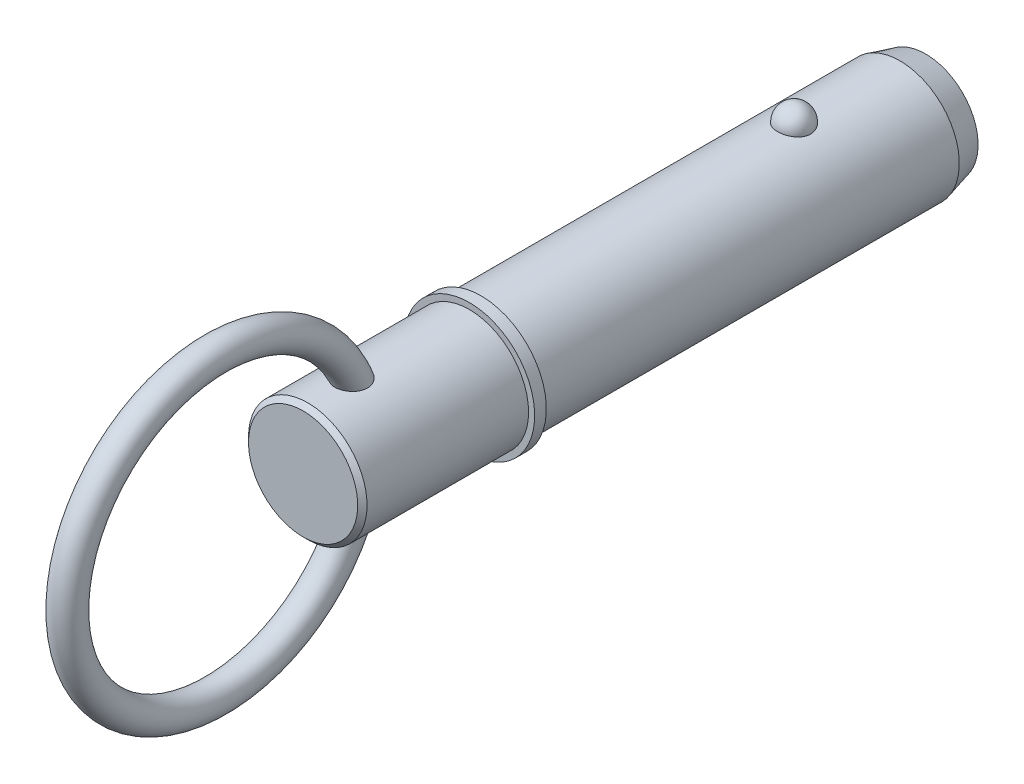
ISO-10303-21;
HEADER;
FILE_DESCRIPTION(('STEP AP214'),'2;1');
FILE_NAME('part.step','',(''),(''),'','','');
FILE_SCHEMA(('AUTOMOTIVE_DESIGN { 1 0 10303 214 1 1 1 1 }'));
ENDSEC;
DATA;
#1=APPLICATION_CONTEXT('core data for automotive mechanical design processes');
#2=APPLICATION_PROTOCOL_DEFINITION('international standard','automotive_design',2000,#1);
#3=PRODUCT_CONTEXT('',#1,'mechanical');
#4=PRODUCT('Part','Part','',(#3));
#5=PRODUCT_RELATED_PRODUCT_CATEGORY('part','',(#4));
#6=PRODUCT_DEFINITION_FORMATION('','',#4);
#7=PRODUCT_DEFINITION_CONTEXT('part definition',#1,'design');
#8=PRODUCT_DEFINITION('design','',#6,#7);
#9=PRODUCT_DEFINITION_SHAPE('','',#8);
#10=(LENGTH_UNIT() NAMED_UNIT(*) SI_UNIT(.MILLI.,.METRE.));
#11=(NAMED_UNIT(*) PLANE_ANGLE_UNIT() SI_UNIT($,.RADIAN.));
#12=(NAMED_UNIT(*) SI_UNIT($,.STERADIAN.) SOLID_ANGLE_UNIT());
#13=UNCERTAINTY_MEASURE_WITH_UNIT(LENGTH_MEASURE(1.E-05),#10,'distance_accuracy_value','');
#14=(GEOMETRIC_REPRESENTATION_CONTEXT(3) GLOBAL_UNCERTAINTY_ASSIGNED_CONTEXT((#13)) GLOBAL_UNIT_ASSIGNED_CONTEXT((#10,
#11,#12)) REPRESENTATION_CONTEXT('',''));
#15=CARTESIAN_POINT('',(0.,0.,0.));
#16=DIRECTION('',(0.,0.,1.));
#17=DIRECTION('',(1.,0.,0.));
#18=AXIS2_PLACEMENT_3D('',#15,#16,#17);
#19=CARTESIAN_POINT('',(0.,0.,63.5));
#20=DIRECTION('',(0.,0.,-1.));
#21=DIRECTION('',(-1.,0.,0.));
#22=AXIS2_PLACEMENT_3D('',#19,#20,#21);
#23=CYLINDRICAL_SURFACE('',#22,12.7);
#24=CARTESIAN_POINT('',(3.52486003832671,12.2010393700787,-3.56));
#25=CARTESIAN_POINT('',(3.52485671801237,12.2010422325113,-3.3610062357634));
#26=CARTESIAN_POINT('',(3.50863187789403,12.2057632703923,-3.16197042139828));
#27=CARTESIAN_POINT('',(3.4441205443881,12.2241207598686,-2.76953945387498));
#28=CARTESIAN_POINT('',(3.39582213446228,12.2377605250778,-2.57614642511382));
#29=CARTESIAN_POINT('',(3.26839193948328,12.2724057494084,-2.20059799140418));
#30=CARTESIAN_POINT('',(3.18927369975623,12.2934079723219,-2.01843769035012));
#31=CARTESIAN_POINT('',(3.00217139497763,12.3404306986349,-1.6703228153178));
#32=CARTESIAN_POINT('',(2.89418796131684,12.3664510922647,-1.50436788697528));
#33=CARTESIAN_POINT('',(2.65144862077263,12.4207616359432,-1.19241975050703));
#34=CARTESIAN_POINT('',(2.51656310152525,12.4490623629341,-1.04652919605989));
#35=CARTESIAN_POINT('',(2.22383249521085,12.5046678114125,-0.779711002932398));
#36=CARTESIAN_POINT('',(2.0659873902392,12.5319725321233,-0.658783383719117));
#37=CARTESIAN_POINT('',(1.73204520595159,12.5824645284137,-0.445586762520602));
#38=CARTESIAN_POINT('',(1.55600183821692,12.6056634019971,-0.353236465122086));
#39=CARTESIAN_POINT('',(1.19021695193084,12.6454411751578,-0.199381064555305));
#40=CARTESIAN_POINT('',(1.00047694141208,12.6620208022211,-0.137872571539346));
#41=CARTESIAN_POINT('',(0.616329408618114,12.6864692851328,-0.0483191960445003));
#42=CARTESIAN_POINT('',(0.422067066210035,12.6944893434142,-0.0196927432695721));
#43=CARTESIAN_POINT('',(0.0313259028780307,12.7014637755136,0.00524116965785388));
#44=CARTESIAN_POINT('',(-0.165152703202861,12.7004190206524,0.00155173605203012));
#45=CARTESIAN_POINT('',(-0.551780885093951,12.6894611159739,-0.0377454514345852));
#46=CARTESIAN_POINT('',(-0.74198078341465,12.6796749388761,-0.0728962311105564));
#47=CARTESIAN_POINT('',(-1.11361063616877,12.6524544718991,-0.173489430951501));
#48=CARTESIAN_POINT('',(-1.29504043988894,12.6350200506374,-0.238932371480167));
#49=CARTESIAN_POINT('',(-1.64521311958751,12.5942270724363,-0.398772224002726));
#50=CARTESIAN_POINT('',(-1.81387645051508,12.5708347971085,-0.493334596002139));
#51=CARTESIAN_POINT('',(-2.13292959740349,12.5206522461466,-0.708731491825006));
#52=CARTESIAN_POINT('',(-2.28331755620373,12.4938616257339,-0.829568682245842));
#53=CARTESIAN_POINT('',(-2.56470285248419,12.4391828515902,-1.0968714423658));
#54=CARTESIAN_POINT('',(-2.69527522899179,12.4112835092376,-1.24378221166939));
#55=CARTESIAN_POINT('',(-2.93023079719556,12.3579248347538,-1.55763192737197));
#56=CARTESIAN_POINT('',(-3.03461212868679,12.3324656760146,-1.72457229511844));
#57=CARTESIAN_POINT('',(-3.21564423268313,12.2865167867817,-2.07598316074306));
#58=CARTESIAN_POINT('',(-3.29196222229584,12.2660875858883,-2.26063321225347));
#59=CARTESIAN_POINT('',(-3.41323771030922,12.2328979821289,-2.64061334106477));
#60=CARTESIAN_POINT('',(-3.45819611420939,12.2201373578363,-2.83594310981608));
#61=CARTESIAN_POINT('',(-3.51550038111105,12.2037762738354,-3.2308649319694));
#62=CARTESIAN_POINT('',(-3.5279827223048,12.200137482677,-3.43043558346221));
#63=CARTESIAN_POINT('',(-3.52041430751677,12.2023234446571,-3.8289025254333));
#64=CARTESIAN_POINT('',(-3.50036443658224,12.2081479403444,-4.02779883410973));
#65=CARTESIAN_POINT('',(-3.42842010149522,12.2285446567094,-4.41824213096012));
#66=CARTESIAN_POINT('',(-3.37668525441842,12.243073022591,-4.6098208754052));
#67=CARTESIAN_POINT('',(-3.24279085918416,12.2792134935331,-4.98132360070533));
#68=CARTESIAN_POINT('',(-3.16063009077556,12.300825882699,-5.16124711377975));
#69=CARTESIAN_POINT('',(-2.96738224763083,12.3488691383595,-5.50542856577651));
#70=CARTESIAN_POINT('',(-2.85613997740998,12.3753256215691,-5.66959579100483));
#71=CARTESIAN_POINT('',(-2.60773241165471,12.4300386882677,-5.97665065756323));
#72=CARTESIAN_POINT('',(-2.47056612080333,12.458295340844,-6.11953748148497));
#73=CARTESIAN_POINT('',(-2.17327999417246,12.5135827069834,-6.38059312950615));
#74=CARTESIAN_POINT('',(-2.01307652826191,12.5406084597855,-6.49866785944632));
#75=CARTESIAN_POINT('',(-1.67442544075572,12.5902954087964,-6.70609314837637));
#76=CARTESIAN_POINT('',(-1.49597909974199,12.6129569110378,-6.79544572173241));
#77=CARTESIAN_POINT('',(-1.12819666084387,12.6511224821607,-6.94192787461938));
#78=CARTESIAN_POINT('',(-0.93902400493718,12.666712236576,-6.99944518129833));
#79=CARTESIAN_POINT('',(-0.553267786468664,12.6894125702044,-7.08227444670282));
#80=CARTESIAN_POINT('',(-0.356685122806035,12.6965241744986,-7.10759029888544));
#81=CARTESIAN_POINT('',(0.0343320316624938,12.7014305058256,-7.12510946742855));
#82=CARTESIAN_POINT('',(0.228736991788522,12.6993986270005,-7.11792901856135));
#83=CARTESIAN_POINT('',(0.613493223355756,12.6866339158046,-7.07206766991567));
#84=CARTESIAN_POINT('',(0.803844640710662,12.6759013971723,-7.03338790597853));
#85=CARTESIAN_POINT('',(1.17440741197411,12.6469443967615,-6.925834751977));
#86=CARTESIAN_POINT('',(1.35465462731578,12.6287486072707,-6.85707692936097));
#87=CARTESIAN_POINT('',(1.70092526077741,12.5867908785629,-6.69128257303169));
#88=CARTESIAN_POINT('',(1.86694777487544,12.5630285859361,-6.59424424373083));
#89=CARTESIAN_POINT('',(2.18289085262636,12.5120350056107,-6.3727748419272));
#90=CARTESIAN_POINT('',(2.33252391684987,12.4847559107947,-6.24794475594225));
#91=CARTESIAN_POINT('',(2.60889724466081,12.4299457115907,-5.97511730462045));
#92=CARTESIAN_POINT('',(2.73563353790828,12.4024145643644,-5.82711592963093));
#93=CARTESIAN_POINT('',(2.96505559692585,12.3495984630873,-5.5091226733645));
#94=CARTESIAN_POINT('',(3.06728335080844,12.3243610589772,-5.33879227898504));
#95=CARTESIAN_POINT('',(3.24218794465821,12.2795120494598,-4.98295005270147));
#96=CARTESIAN_POINT('',(3.31487538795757,12.2598984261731,-4.79744369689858));
#97=CARTESIAN_POINT('',(3.42255689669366,12.2302435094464,-4.43775244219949));
#98=CARTESIAN_POINT('',(3.46085292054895,12.2193780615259,-4.264615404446));
#99=CARTESIAN_POINT('',(3.5120056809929,12.2047747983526,-3.9143299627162));
#100=CARTESIAN_POINT('',(3.52486299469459,12.2010368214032,-3.73718164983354));
#101=CARTESIAN_POINT('',(3.52486003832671,12.2010393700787,-3.56));
#102=B_SPLINE_CURVE_WITH_KNOTS('',3,(#24,#25,#26,#27,#28,#29,#30,#31,#32,#33,#34,#35,#36,#37,
#38,#39,#40,#41,#42,#43,#44,#45,#46,#47,#48,#49,#50,#51,#52,#53,#54,#55,#56,#57,#58,#59,#60,#61,
#62,#63,#64,#65,#66,#67,#68,#69,#70,#71,#72,#73,#74,#75,#76,#77,#78,#79,#80,#81,#82,#83,#84,#85,
#86,#87,#88,#89,#90,#91,#92,#93,#94,#95,#96,#97,#98,#99,#100,#101),.UNSPECIFIED.,.T.,.F.,(4,2,2,
2,2,2,2,2,2,2,2,2,2,2,2,2,2,2,2,2,2,2,2,2,2,2,2,2,2,2,2,2,2,2,2,2,2,2,4),(0.,0.596344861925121,
1.19291141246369,1.78921606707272,2.38550767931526,2.98474477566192,3.58398233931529,
4.18149920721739,4.77895038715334,5.36566361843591,5.95232045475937,6.53059198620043,
7.10887345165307,7.6905033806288,8.27219236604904,8.86498552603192,9.45782077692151,
10.0574751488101,10.6571122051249,11.2542252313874,11.8513220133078,12.4454353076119,
13.0395724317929,13.636947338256,14.2343451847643,14.8339691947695,15.4335511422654,
16.0256602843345,16.6176978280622,17.1985559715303,17.7793931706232,18.3580179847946,
18.9366795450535,19.5242567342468,20.1119357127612,20.7098642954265,21.3075780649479,
21.8385683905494,22.3695466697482),.UNSPECIFIED.);
#103=CARTESIAN_POINT('',(3.52486003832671,12.2010393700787,-3.56));
#104=VERTEX_POINT('',#103);
#105=EDGE_CURVE('E102',#104,#104,#102,.T.);
#106=ORIENTED_EDGE('',*,*,#105,.T.);
#107=EDGE_LOOP('',(#106));
#108=FACE_BOUND('',#107,.T.);
#109=CARTESIAN_POINT('',(0.,0.,-26.2499999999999));
#110=DIRECTION('',(0.,0.,-1.));
#111=DIRECTION('',(-1.,0.,0.));
#112=AXIS2_PLACEMENT_3D('',#109,#110,#111);
#113=CIRCLE('',#112,12.7);
#114=CARTESIAN_POINT('',(-12.7,0.,-26.2499999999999));
#115=VERTEX_POINT('',#114);
#116=EDGE_CURVE('E110',#115,#115,#113,.F.);
#117=ORIENTED_EDGE('',*,*,#116,.T.);
#118=EDGE_LOOP('',(#117));
#119=FACE_BOUND('',#118,.T.);
#120=CARTESIAN_POINT('',(0.,0.,63.5));
#121=DIRECTION('',(0.,0.,1.));
#122=DIRECTION('',(1.,0.,0.));
#123=AXIS2_PLACEMENT_3D('',#120,#121,#122);
#124=CIRCLE('',#123,12.7);
#125=CARTESIAN_POINT('',(12.7,0.,63.5));
#126=VERTEX_POINT('',#125);
#127=EDGE_CURVE('E108',#126,#126,#124,.T.);
#128=ORIENTED_EDGE('',*,*,#127,.F.);
#129=EDGE_LOOP('',(#128));
#130=FACE_BOUND('',#129,.T.);
#131=ADVANCED_FACE('F39',(#108,#119,#130),#23,.T.);
#132=CARTESIAN_POINT('',(0.,0.,-31.75));
#133=DIRECTION('',(0.,0.,-1.));
#134=DIRECTION('',(-1.,0.,0.));
#135=AXIS2_PLACEMENT_3D('',#132,#133,#134);
#136=PLANE('',#135);
#137=CARTESIAN_POINT('',(0.,0.,-31.75));
#138=DIRECTION('',(0.,0.,-1.));
#139=DIRECTION('',(-1.,0.,0.));
#140=AXIS2_PLACEMENT_3D('',#137,#138,#139);
#141=CIRCLE('',#140,11.2262794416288);
#142=CARTESIAN_POINT('',(-11.2262794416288,0.,-31.75));
#143=VERTEX_POINT('',#142);
#144=EDGE_CURVE('E142',#143,#143,#141,.T.);
#145=ORIENTED_EDGE('',*,*,#144,.T.);
#146=EDGE_LOOP('',(#145));
#147=FACE_BOUND('',#146,.T.);
#148=ADVANCED_FACE('F88',(#147),#136,.T.);
#149=CARTESIAN_POINT('',(0.,0.,-31.75));
#150=DIRECTION('',(0.,0.,1.));
#151=DIRECTION('',(1.,0.,0.));
#152=AXIS2_PLACEMENT_3D('',#149,#150,#151);
#153=CONICAL_SURFACE('',#152,11.2262794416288,0.261799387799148);
#154=ORIENTED_EDGE('',*,*,#116,.F.);
#155=EDGE_LOOP('',(#154));
#156=FACE_BOUND('',#155,.T.);
#157=ORIENTED_EDGE('',*,*,#144,.F.);
#158=EDGE_LOOP('',(#157));
#159=FACE_BOUND('',#158,.T.);
#160=ADVANCED_FACE('F94',(#156,#159),#153,.T.);
#161=CARTESIAN_POINT('',(0.,12.7,-3.56));
#162=DIRECTION('',(0.,1.,0.));
#163=DIRECTION('',(0.,0.,1.));
#164=AXIS2_PLACEMENT_3D('',#161,#162,#163);
#165=SPHERICAL_SURFACE('',#164,3.56);
#166=ORIENTED_EDGE('',*,*,#105,.F.);
#167=EDGE_LOOP('',(#166));
#168=FACE_BOUND('',#167,.T.);
#169=ADVANCED_FACE('F113',(#168),#165,.T.);
#170=CARTESIAN_POINT('',(0.,0.,63.5));
#171=DIRECTION('',(0.,0.,-1.));
#172=DIRECTION('',(-1.,0.,0.));
#173=AXIS2_PLACEMENT_3D('',#170,#171,#172);
#174=PLANE('',#173);
#175=ORIENTED_EDGE('',*,*,#127,.T.);
#176=EDGE_LOOP('',(#175));
#177=FACE_BOUND('',#176,.T.);
#178=CARTESIAN_POINT('',(0.,0.,63.5));
#179=DIRECTION('',(0.,0.,-1.));
#180=DIRECTION('',(-1.,0.,0.));
#181=AXIS2_PLACEMENT_3D('',#178,#179,#180);
#182=CIRCLE('',#181,14.);
#183=CARTESIAN_POINT('',(-14.,0.,63.5));
#184=VERTEX_POINT('',#183);
#185=EDGE_CURVE('E109',#184,#184,#182,.T.);
#186=ORIENTED_EDGE('',*,*,#185,.T.);
#187=EDGE_LOOP('',(#186));
#188=FACE_BOUND('',#187,.T.);
#189=ADVANCED_FACE('F117',(#177,#188),#174,.T.);
#190=CARTESIAN_POINT('',(0.,0.,33.7287874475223));
#191=DIRECTION('',(0.,0.,-1.));
#192=DIRECTION('',(-1.,0.,0.));
#193=AXIS2_PLACEMENT_3D('',#190,#191,#192);
#194=CYLINDRICAL_SURFACE('',#193,14.);
#195=CARTESIAN_POINT('',(0.,0.,66.));
#196=DIRECTION('',(0.,0.,-1.));
#197=DIRECTION('',(-1.,0.,0.));
#198=AXIS2_PLACEMENT_3D('',#195,#196,#197);
#199=CIRCLE('',#198,14.);
#200=CARTESIAN_POINT('',(-14.,0.,66.));
#201=VERTEX_POINT('',#200);
#202=EDGE_CURVE('E134',#201,#201,#199,.T.);
#203=ORIENTED_EDGE('',*,*,#202,.T.);
#204=EDGE_LOOP('',(#203));
#205=FACE_BOUND('',#204,.T.);
#206=ORIENTED_EDGE('',*,*,#185,.F.);
#207=EDGE_LOOP('',(#206));
#208=FACE_BOUND('',#207,.T.);
#209=ADVANCED_FACE('F121',(#205,#208),#194,.T.);
#210=CARTESIAN_POINT('',(0.,14.,66.));
#211=DIRECTION('',(0.,0.,1.));
#212=DIRECTION('',(1.,0.,0.));
#213=AXIS2_PLACEMENT_3D('',#210,#211,#212);
#214=PLANE('',#213);
#215=CARTESIAN_POINT('',(0.,0.,66.));
#216=DIRECTION('',(0.,0.,1.));
#217=DIRECTION('',(1.,0.,0.));
#218=AXIS2_PLACEMENT_3D('',#215,#216,#217);
#219=CIRCLE('',#218,12.7);
#220=CARTESIAN_POINT('',(12.7,0.,66.));
#221=VERTEX_POINT('',#220);
#222=EDGE_CURVE('E112',#221,#221,#219,.T.);
#223=ORIENTED_EDGE('',*,*,#222,.F.);
#224=EDGE_LOOP('',(#223));
#225=FACE_BOUND('',#224,.T.);
#226=ORIENTED_EDGE('',*,*,#202,.F.);
#227=EDGE_LOOP('',(#226));
#228=FACE_BOUND('',#227,.T.);
#229=ADVANCED_FACE('F85',(#225,#228),#214,.T.);
#230=CARTESIAN_POINT('',(0.,0.,101.6));
#231=DIRECTION('',(0.,0.,-1.));
#232=DIRECTION('',(-1.,0.,0.));
#233=AXIS2_PLACEMENT_3D('',#230,#231,#232);
#234=CYLINDRICAL_SURFACE('',#233,12.7);
#235=CARTESIAN_POINT('',(-1.22892607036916,-12.6404011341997,87.9711939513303));
#236=CARTESIAN_POINT('',(-1.06119922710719,-12.6567092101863,87.9040042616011));
#237=CARTESIAN_POINT('',(-0.887663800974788,-12.6701810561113,87.8507925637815));
#238=CARTESIAN_POINT('',(-0.533823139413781,-12.6900116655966,87.7734192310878));
#239=CARTESIAN_POINT('',(-0.353518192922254,-12.6963707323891,87.7492563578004));
#240=CARTESIAN_POINT('',(0.00871153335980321,-12.7012887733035,87.7305190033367));
#241=CARTESIAN_POINT('',(0.190636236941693,-12.699848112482,87.7359431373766));
#242=CARTESIAN_POINT('',(0.550971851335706,-12.6893231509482,87.7762551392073));
#243=CARTESIAN_POINT('',(0.729382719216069,-12.6802387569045,87.8111433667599));
#244=CARTESIAN_POINT('',(1.07771687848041,-12.6553960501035,87.9096598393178));
#245=CARTESIAN_POINT('',(1.24763507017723,-12.6396337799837,87.973305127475));
#246=CARTESIAN_POINT('',(1.57398922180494,-12.6031560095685,88.1278916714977));
#247=CARTESIAN_POINT('',(1.73042571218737,-12.5824407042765,88.2188318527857));
#248=CARTESIAN_POINT('',(2.02464767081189,-12.5384554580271,88.4253206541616));
#249=CARTESIAN_POINT('',(2.16251370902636,-12.5151974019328,88.5407569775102));
#250=CARTESIAN_POINT('',(2.41652917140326,-12.4686447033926,88.7934261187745));
#251=CARTESIAN_POINT('',(2.53268123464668,-12.4453500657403,88.930656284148));
#252=CARTESIAN_POINT('',(2.7397169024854,-12.4014166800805,89.2222617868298));
#253=CARTESIAN_POINT('',(2.83072997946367,-12.3807646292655,89.3765433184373));
#254=CARTESIAN_POINT('',(2.98642630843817,-12.3441356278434,89.698338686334));
#255=CARTESIAN_POINT('',(3.05110876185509,-12.3281588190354,89.8658529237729));
#256=CARTESIAN_POINT('',(3.15450336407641,-12.3021148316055,90.2127059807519));
#257=CARTESIAN_POINT('',(3.19268116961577,-12.2921697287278,90.3922122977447));
#258=CARTESIAN_POINT('',(3.24150148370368,-12.2793848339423,90.7551447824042));
#259=CARTESIAN_POINT('',(3.25213515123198,-12.2765473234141,90.9385721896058));
#260=CARTESIAN_POINT('',(3.24696781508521,-12.2779158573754,91.3188932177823));
#261=CARTESIAN_POINT('',(3.22910261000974,-12.2826719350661,91.5157539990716));
#262=CARTESIAN_POINT('',(3.16504953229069,-12.2993299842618,91.9044791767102));
#263=CARTESIAN_POINT('',(3.11884966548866,-12.3112349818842,92.0963414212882));
#264=CARTESIAN_POINT('',(2.99323123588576,-12.3424162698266,92.4928913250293));
#265=CARTESIAN_POINT('',(2.91059577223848,-12.3623844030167,92.6965057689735));
#266=CARTESIAN_POINT('',(2.71447440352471,-12.4069229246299,93.0881909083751));
#267=CARTESIAN_POINT('',(2.60094970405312,-12.431499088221,93.2762416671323));
#268=CARTESIAN_POINT('',(2.40499526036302,-12.4703951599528,93.5474701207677));
#269=CARTESIAN_POINT('',(2.3330184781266,-12.4841083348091,93.6384072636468));
#270=CARTESIAN_POINT('',(2.18106597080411,-12.5115521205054,93.8133206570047));
#271=CARTESIAN_POINT('',(2.10108885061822,-12.5252827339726,93.8972956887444));
#272=CARTESIAN_POINT('',(1.8497396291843,-12.5657115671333,94.1367795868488));
#273=CARTESIAN_POINT('',(1.6664677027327,-12.5917488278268,94.2805264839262));
#274=CARTESIAN_POINT('',(1.33551340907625,-12.6303067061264,94.4858562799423));
#275=CARTESIAN_POINT('',(1.19512135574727,-12.6444898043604,94.5590224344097));
#276=CARTESIAN_POINT('',(0.903945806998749,-12.6686276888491,94.6815868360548));
#277=CARTESIAN_POINT('',(0.7531733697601,-12.6785868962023,94.7310099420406));
#278=CARTESIAN_POINT('',(0.444090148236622,-12.6931800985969,94.8029423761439));
#279=CARTESIAN_POINT('',(0.285741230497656,-12.6977833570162,94.8252963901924));
#280=CARTESIAN_POINT('',(-0.0324491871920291,-12.700953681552,94.8407247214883));
#281=CARTESIAN_POINT('',(-0.192290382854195,-12.6995219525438,94.8338048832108));
#282=CARTESIAN_POINT('',(-0.49382263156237,-12.6912132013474,94.7932090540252));
#283=CARTESIAN_POINT('',(-0.635865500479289,-12.6848307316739,94.7619622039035));
#284=CARTESIAN_POINT('',(-0.913041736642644,-12.6678986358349,94.6777216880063));
#285=CARTESIAN_POINT('',(-1.0481734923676,-12.6573480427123,94.6247229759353));
#286=CARTESIAN_POINT('',(-1.31637898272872,-12.6323524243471,94.4962339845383));
#287=CARTESIAN_POINT('',(-1.44890088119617,-12.6177203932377,94.4196381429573));
#288=CARTESIAN_POINT('',(-1.70162176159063,-12.5861326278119,94.2487430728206));
#289=CARTESIAN_POINT('',(-1.82181486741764,-12.569175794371,94.1544354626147));
#290=CARTESIAN_POINT('',(-2.06961284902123,-12.5309682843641,93.9326655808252));
#291=CARTESIAN_POINT('',(-2.19457628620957,-12.5094982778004,93.8022933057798));
#292=CARTESIAN_POINT('',(-2.42503767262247,-12.4668738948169,93.5253083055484));
#293=CARTESIAN_POINT('',(-2.53052086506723,-12.4457197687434,93.3786834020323));
#294=CARTESIAN_POINT('',(-2.7396115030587,-12.4015349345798,93.043065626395));
#295=CARTESIAN_POINT('',(-2.83895917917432,-12.3789253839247,92.8513469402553));
#296=CARTESIAN_POINT('',(-3.00725804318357,-12.3391195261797,92.4544056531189));
#297=CARTESIAN_POINT('',(-3.07618857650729,-12.3219268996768,92.2491739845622));
#298=CARTESIAN_POINT('',(-3.18528660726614,-12.2942052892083,91.8137546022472));
#299=CARTESIAN_POINT('',(-3.22287145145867,-12.2842816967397,91.5828554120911));
#300=CARTESIAN_POINT('',(-3.24821271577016,-12.2775854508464,91.2343510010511));
#301=CARTESIAN_POINT('',(-3.2514823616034,-12.276719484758,91.117777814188));
#302=CARTESIAN_POINT('',(-3.24729041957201,-12.2778310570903,90.8848590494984));
#303=CARTESIAN_POINT('',(-3.23983534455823,-12.2798068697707,90.7685133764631));
#304=CARTESIAN_POINT('',(-3.21488959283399,-12.286359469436,90.54622762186));
#305=CARTESIAN_POINT('',(-3.19823165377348,-12.2907201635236,90.4401869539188));
#306=CARTESIAN_POINT('',(-3.15537465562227,-12.3017926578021,90.2302225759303));
#307=CARTESIAN_POINT('',(-3.12918076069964,-12.3085031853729,90.1262977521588));
#308=CARTESIAN_POINT('',(-3.06721568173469,-12.3240904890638,89.9215537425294));
#309=CARTESIAN_POINT('',(-3.03144854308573,-12.3329663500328,89.8207332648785));
#310=CARTESIAN_POINT('',(-2.95042598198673,-12.3525998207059,89.6231715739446));
#311=CARTESIAN_POINT('',(-2.90517160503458,-12.3633572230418,89.5264299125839));
#312=CARTESIAN_POINT('',(-2.81116315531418,-12.3850478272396,89.3488579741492));
#313=CARTESIAN_POINT('',(-2.76340897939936,-12.3958187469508,89.2674768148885));
#314=CARTESIAN_POINT('',(-2.66091958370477,-12.4182228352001,89.1093176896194));
#315=CARTESIAN_POINT('',(-2.60618212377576,-12.4298562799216,89.0325412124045));
#316=CARTESIAN_POINT('',(-2.49013138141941,-12.4536239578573,88.8842781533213));
#317=CARTESIAN_POINT('',(-2.4288215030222,-12.4657579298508,88.8127888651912));
#318=CARTESIAN_POINT('',(-2.30002146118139,-12.4901640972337,88.6755874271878));
#319=CARTESIAN_POINT('',(-2.23252894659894,-12.5024363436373,88.6098774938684));
#320=CARTESIAN_POINT('',(-2.09370795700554,-12.5264205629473,88.4863775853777));
#321=CARTESIAN_POINT('',(-2.02252382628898,-12.5381388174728,88.4284267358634));
#322=CARTESIAN_POINT('',(-1.87531735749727,-12.5610012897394,88.31889123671));
#323=CARTESIAN_POINT('',(-1.79929316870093,-12.5721452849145,88.2673090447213));
#324=CARTESIAN_POINT('',(-1.5648528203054,-12.6042047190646,88.1227065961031));
#325=CARTESIAN_POINT('',(-1.39990754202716,-12.6237766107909,88.0396874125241));
#326=CARTESIAN_POINT('',(-1.22892607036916,-12.6404011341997,87.9711939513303));
#327=B_SPLINE_CURVE_WITH_KNOTS('',3,(#235,#236,#237,#238,#239,#240,#241,#242,#243,#244,#245,
#246,#247,#248,#249,#250,#251,#252,#253,#254,#255,#256,#257,#258,#259,#260,#261,#262,#263,#264,
#265,#266,#267,#268,#269,#270,#271,#272,#273,#274,#275,#276,#277,#278,#279,#280,#281,#282,#283,
#284,#285,#286,#287,#288,#289,#290,#291,#292,#293,#294,#295,#296,#297,#298,#299,#300,#301,#302,
#303,#304,#305,#306,#307,#308,#309,#310,#311,#312,#313,#314,#315,#316,#317,#318,#319,#320,#321,
#322,#323,#324,#325,#326),.UNSPECIFIED.,.T.,.F.,(4,2,2,2,2,2,2,2,2,2,2,2,2,2,2,2,2,2,2,2,2,2,2,
2,2,2,2,2,2,2,2,2,2,2,2,2,2,2,2,2,2,2,2,2,2,4),(0.,0.543509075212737,1.08699497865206,
1.63045544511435,2.17392254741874,2.71771216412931,3.26148037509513,3.80280767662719,
4.34406914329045,4.88248866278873,5.42092451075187,5.96992270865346,6.51909710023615,
7.10988630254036,7.70092576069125,8.36013748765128,9.02018098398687,9.37009147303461,
9.72006308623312,10.4175255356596,10.8925536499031,11.3670833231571,11.844322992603,
12.3214673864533,12.7562647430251,13.1911630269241,13.6507378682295,14.1105307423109,
14.6541210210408,15.198121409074,15.8467121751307,16.4957426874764,17.1940750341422,
17.5435132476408,17.8927393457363,18.2145822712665,18.5362511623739,18.8577843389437,
19.1792821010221,19.4638320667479,19.7484735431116,20.0329683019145,20.3175717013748,
20.5948148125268,20.8721645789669,21.4262200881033),.UNSPECIFIED.);
#328=CARTESIAN_POINT('',(-1.22892607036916,-12.6404011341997,87.9711939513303));
#329=VERTEX_POINT('',#328);
#330=EDGE_CURVE('E10',#329,#329,#327,.T.);
#331=ORIENTED_EDGE('',*,*,#330,.F.);
#332=EDGE_LOOP('',(#331));
#333=FACE_BOUND('',#332,.T.);
#334=CARTESIAN_POINT('',(-1.22892607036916,12.6404011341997,87.9711939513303));
#335=CARTESIAN_POINT('',(-1.39512541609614,12.624240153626,88.03776712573));
#336=CARTESIAN_POINT('',(-1.55582432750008,12.6052778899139,88.1181538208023));
#337=CARTESIAN_POINT('',(-1.86136954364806,12.5638060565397,88.3046587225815));
#338=CARTESIAN_POINT('',(-2.00617769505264,12.5412882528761,88.4108369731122));
#339=CARTESIAN_POINT('',(-2.27547906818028,12.4952333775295,88.6461035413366));
#340=CARTESIAN_POINT('',(-2.39998742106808,12.4716970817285,88.7751746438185));
#341=CARTESIAN_POINT('',(-2.62534229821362,12.4262157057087,89.0526236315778));
#342=CARTESIAN_POINT('',(-2.72620384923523,12.4042696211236,89.2009891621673));
#343=CARTESIAN_POINT('',(-2.90197976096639,12.3643304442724,89.5126750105));
#344=CARTESIAN_POINT('',(-2.97691335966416,12.3463344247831,89.6759841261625));
#345=CARTESIAN_POINT('',(-3.09983588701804,12.3160482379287,90.0129272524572));
#346=CARTESIAN_POINT('',(-3.14781852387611,12.3037594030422,90.186563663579));
#347=CARTESIAN_POINT('',(-3.21809353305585,12.2855709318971,90.5455239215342));
#348=CARTESIAN_POINT('',(-3.23943500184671,12.2799082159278,90.731044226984));
#349=CARTESIAN_POINT('',(-3.2544382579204,12.2759385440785,91.1032324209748));
#350=CARTESIAN_POINT('',(-3.24809142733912,12.2776338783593,91.289900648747));
#351=CARTESIAN_POINT('',(-3.20755159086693,12.288291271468,91.6775770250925));
#352=CARTESIAN_POINT('',(-3.17081691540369,12.2979162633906,91.878299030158));
#353=CARTESIAN_POINT('',(-3.06845850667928,12.3238513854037,92.2718580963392));
#354=CARTESIAN_POINT('',(-3.00281105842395,12.3401670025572,92.4646885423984));
#355=CARTESIAN_POINT('',(-2.83560995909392,12.3797223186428,92.8594732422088));
#356=CARTESIAN_POINT('',(-2.73085133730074,12.4035339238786,93.0600192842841));
#357=CARTESIAN_POINT('',(-2.48976141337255,12.4541651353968,93.4408130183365));
#358=CARTESIAN_POINT('',(-2.35343772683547,12.4809840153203,93.6210655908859));
#359=CARTESIAN_POINT('',(-2.07683984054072,12.5296806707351,93.9256599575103));
#360=CARTESIAN_POINT('',(-1.94129351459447,12.551613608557,94.0542839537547));
#361=CARTESIAN_POINT('',(-1.65081707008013,12.5931023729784,94.2878364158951));
#362=CARTESIAN_POINT('',(-1.49591505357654,12.6126615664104,94.3927986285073));
#363=CARTESIAN_POINT('',(-1.19690065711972,12.6442092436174,94.5577889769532));
#364=CARTESIAN_POINT('',(-1.05541267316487,12.6569190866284,94.6224184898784));
#365=CARTESIAN_POINT('',(-0.763415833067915,12.6778764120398,94.7276387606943));
#366=CARTESIAN_POINT('',(-0.612913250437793,12.6861269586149,94.7682460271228));
#367=CARTESIAN_POINT('',(-0.306168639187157,12.697239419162,94.8227152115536));
#368=CARTESIAN_POINT('',(-0.149903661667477,12.7000767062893,94.8364549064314));
#369=CARTESIAN_POINT('',(0.162552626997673,12.699920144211,94.8356942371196));
#370=CARTESIAN_POINT('',(0.318743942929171,12.6969267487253,94.821196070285));
#371=CARTESIAN_POINT('',(0.614555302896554,12.6859231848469,94.7672341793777));
#372=CARTESIAN_POINT('',(0.754548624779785,12.6782987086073,94.7296876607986));
#373=CARTESIAN_POINT('',(1.02685044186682,12.6591561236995,94.6337115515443));
#374=CARTESIAN_POINT('',(1.15915690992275,12.6476369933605,94.5752764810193));
#375=CARTESIAN_POINT('',(1.42405861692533,12.6206654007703,94.4349885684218));
#376=CARTESIAN_POINT('',(1.55582877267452,12.604971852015,94.3516353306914));
#377=CARTESIAN_POINT('',(1.80621935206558,12.571537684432,94.1674980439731));
#378=CARTESIAN_POINT('',(1.92483289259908,12.5537960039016,94.0667049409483));
#379=CARTESIAN_POINT('',(2.16936918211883,12.5140714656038,93.8301745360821));
#380=CARTESIAN_POINT('',(2.29236422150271,12.4919255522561,93.6914396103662));
#381=CARTESIAN_POINT('',(2.51762485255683,12.4484835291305,93.3979131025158));
#382=CARTESIAN_POINT('',(2.61987416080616,12.4271880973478,93.2431090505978));
#383=CARTESIAN_POINT('',(2.81956306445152,12.3835520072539,92.8913163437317));
#384=CARTESIAN_POINT('',(2.91268031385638,12.3617361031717,92.691798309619));
#385=CARTESIAN_POINT('',(3.06675738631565,12.3244204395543,92.2798981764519));
#386=CARTESIAN_POINT('',(3.12769905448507,12.3089242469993,92.0675088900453));
#387=CARTESIAN_POINT('',(3.19410612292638,12.2917937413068,91.7377293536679));
#388=CARTESIAN_POINT('',(3.21217746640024,12.2870696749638,91.6229179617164));
#389=CARTESIAN_POINT('',(3.23822570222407,12.2802317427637,91.3920954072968));
#390=CARTESIAN_POINT('',(3.24620727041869,12.2781166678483,91.2760848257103));
#391=CARTESIAN_POINT('',(3.25166839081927,12.2766712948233,91.0438104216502));
#392=CARTESIAN_POINT('',(3.24914931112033,12.2773406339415,90.9275466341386));
#393=CARTESIAN_POINT('',(3.23325304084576,12.2815367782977,90.6958693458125));
#394=CARTESIAN_POINT('',(3.2198826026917,12.2850618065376,90.5804553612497));
#395=CARTESIAN_POINT('',(3.18378347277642,12.2944635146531,90.3621887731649));
#396=CARTESIAN_POINT('',(3.16203615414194,12.3000921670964,90.2591627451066));
#397=CARTESIAN_POINT('',(3.109310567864,12.3135262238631,90.0556941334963));
#398=CARTESIAN_POINT('',(3.07833729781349,12.3213304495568,89.95525018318));
#399=CARTESIAN_POINT('',(3.00719503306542,12.3388864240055,89.7578823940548));
#400=CARTESIAN_POINT('',(2.96702904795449,12.34863753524,89.6609574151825));
#401=CARTESIAN_POINT('',(2.87766260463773,12.3697681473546,89.4715530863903));
#402=CARTESIAN_POINT('',(2.82846300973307,12.3811474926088,89.379073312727));
#403=CARTESIAN_POINT('',(2.72718770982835,12.4038233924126,89.2092787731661));
#404=CARTESIAN_POINT('',(2.67601025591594,12.4149937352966,89.1314098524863));
#405=CARTESIAN_POINT('',(2.56702778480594,12.4379850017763,88.9805146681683));
#406=CARTESIAN_POINT('',(2.50922051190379,12.4498061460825,88.907490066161));
#407=CARTESIAN_POINT('',(2.38741431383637,12.4737362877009,88.7669157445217));
#408=CARTESIAN_POINT('',(2.32341881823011,12.4858451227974,88.6993630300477));
#409=CARTESIAN_POINT('',(2.18967865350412,12.5099935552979,88.5701830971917));
#410=CARTESIAN_POINT('',(2.11993188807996,12.5220331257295,88.5085580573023));
#411=CARTESIAN_POINT('',(1.90863625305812,12.5565453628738,88.3379714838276));
#412=CARTESIAN_POINT('',(1.75996750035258,12.5784460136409,88.2375080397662));
#413=CARTESIAN_POINT('',(1.44761854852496,12.6182083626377,88.0627484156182));
#414=CARTESIAN_POINT('',(1.28394037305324,12.6360706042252,87.9884487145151));
#415=CARTESIAN_POINT('',(0.945887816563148,12.6658634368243,87.8675372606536));
#416=CARTESIAN_POINT('',(0.771499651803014,12.6777861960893,87.8209620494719));
#417=CARTESIAN_POINT('',(0.417041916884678,12.694390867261,87.7566734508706));
#418=CARTESIAN_POINT('',(0.236969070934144,12.6990685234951,87.7389770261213));
#419=CARTESIAN_POINT('',(-0.12487967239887,12.7006841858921,87.7328291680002));
#420=CARTESIAN_POINT('',(-0.30665891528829,12.6975703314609,87.7445736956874));
#421=CARTESIAN_POINT('',(-0.665297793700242,12.6838264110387,87.7974733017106));
#422=CARTESIAN_POINT('',(-0.842168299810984,12.6732146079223,87.8385569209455));
#423=CARTESIAN_POINT('',(-1.05025519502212,12.6565519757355,87.905394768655));
#424=CARTESIAN_POINT('',(-1.08632235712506,12.6535053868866,87.9176815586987));
#425=CARTESIAN_POINT('',(-1.15798463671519,12.6471484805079,87.9435019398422));
#426=CARTESIAN_POINT('',(-1.19357974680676,12.643838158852,87.9570355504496));
#427=CARTESIAN_POINT('',(-1.22892607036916,12.6404011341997,87.9711939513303));
#428=B_SPLINE_CURVE_WITH_KNOTS('',3,(#334,#335,#336,#337,#338,#339,#340,#341,#342,#343,#344,
#345,#346,#347,#348,#349,#350,#351,#352,#353,#354,#355,#356,#357,#358,#359,#360,#361,#362,#363,
#364,#365,#366,#367,#368,#369,#370,#371,#372,#373,#374,#375,#376,#377,#378,#379,#380,#381,#382,
#383,#384,#385,#386,#387,#388,#389,#390,#391,#392,#393,#394,#395,#396,#397,#398,#399,#400,#401,
#402,#403,#404,#405,#406,#407,#408,#409,#410,#411,#412,#413,#414,#415,#416,#417,#418,#419,#420,
#421,#422,#423,#424,#425,#426,#427),.UNSPECIFIED.,.T.,.F.,(4,2,2,2,2,2,2,2,2,2,2,2,2,2,2,2,2,2,
2,2,2,2,2,2,2,2,2,2,2,2,2,2,2,2,2,2,2,2,2,2,2,2,2,2,2,2,4),(0.,0.539146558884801,
1.07956050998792,1.61956978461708,2.15923496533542,2.69849886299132,3.23788860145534,
3.796026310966,4.35433775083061,4.96471598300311,5.57559579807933,6.25509482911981,
6.93443009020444,7.49671429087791,8.05819140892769,8.52445959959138,8.99040698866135,
9.45846913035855,9.92649485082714,10.3600530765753,10.7937251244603,11.2621204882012,
11.7307597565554,12.2888675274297,12.8474116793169,13.5084064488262,14.1697737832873,
14.5183408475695,14.8667463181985,15.2151063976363,15.5632498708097,15.8791508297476,
16.1948809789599,16.5105079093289,16.826104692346,17.1072964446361,17.3885841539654,
17.669716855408,17.9509524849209,18.4904482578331,19.0298713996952,19.5700039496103,
20.1104536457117,20.6545101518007,21.1972460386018,21.3119068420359,21.4265694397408),.UNSPECIFIED.);
#429=CARTESIAN_POINT('',(-1.22892607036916,12.6404011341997,87.9711939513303));
#430=VERTEX_POINT('',#429);
#431=EDGE_CURVE('E51',#430,#430,#428,.T.);
#432=ORIENTED_EDGE('',*,*,#431,.F.);
#433=EDGE_LOOP('',(#432));
#434=FACE_BOUND('',#433,.T.);
#435=CARTESIAN_POINT('',(0.,0.,100.6));
#436=DIRECTION('',(0.,0.,-1.));
#437=DIRECTION('',(-1.,0.,0.));
#438=AXIS2_PLACEMENT_3D('',#435,#436,#437);
#439=CIRCLE('',#438,12.7);
#440=CARTESIAN_POINT('',(-12.7,0.,100.6));
#441=VERTEX_POINT('',#440);
#442=EDGE_CURVE('E64',#441,#441,#439,.T.);
#443=ORIENTED_EDGE('',*,*,#442,.T.);
#444=EDGE_LOOP('',(#443));
#445=FACE_BOUND('',#444,.T.);
#446=ORIENTED_EDGE('',*,*,#222,.T.);
#447=EDGE_LOOP('',(#446));
#448=FACE_BOUND('',#447,.T.);
#449=ADVANCED_FACE('F69',(#333,#434,#445,#448),#234,.T.);
#450=CARTESIAN_POINT('',(0.,0.,101.6));
#451=DIRECTION('',(0.,0.,-1.));
#452=DIRECTION('',(-1.,0.,0.));
#453=AXIS2_PLACEMENT_3D('',#450,#451,#452);
#454=PLANE('',#453);
#455=CARTESIAN_POINT('',(0.,0.,101.6));
#456=DIRECTION('',(0.,0.,-1.));
#457=DIRECTION('',(-1.,0.,0.));
#458=AXIS2_PLACEMENT_3D('',#455,#456,#457);
#459=CIRCLE('',#458,11.7);
#460=CARTESIAN_POINT('',(-11.7,0.,101.6));
#461=VERTEX_POINT('',#460);
#462=EDGE_CURVE('E58',#461,#461,#459,.F.);
#463=ORIENTED_EDGE('',*,*,#462,.T.);
#464=EDGE_LOOP('',(#463));
#465=FACE_BOUND('',#464,.T.);
#466=ADVANCED_FACE('F76',(#465),#454,.F.);
#467=CARTESIAN_POINT('',(0.,0.,100.6));
#468=DIRECTION('',(0.,0.,-1.));
#469=DIRECTION('',(-1.,0.,0.));
#470=AXIS2_PLACEMENT_3D('',#467,#468,#469);
#471=CONICAL_SURFACE('',#470,12.7,0.785398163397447);
#472=ORIENTED_EDGE('',*,*,#462,.F.);
#473=EDGE_LOOP('',(#472));
#474=FACE_BOUND('',#473,.T.);
#475=ORIENTED_EDGE('',*,*,#442,.F.);
#476=EDGE_LOOP('',(#475));
#477=FACE_BOUND('',#476,.T.);
#478=ADVANCED_FACE('F41',(#474,#477),#471,.T.);
#479=CARTESIAN_POINT('',(0.,0.,120.35));
#480=DIRECTION('',(1.,0.,0.));
#481=DIRECTION('',(0.,0.,-1.));
#482=AXIS2_PLACEMENT_3D('',#479,#480,#481);
#483=TOROIDAL_SURFACE('',#482,31.75,3.25);
#484=ORIENTED_EDGE('',*,*,#330,.T.);
#485=EDGE_LOOP('',(#484));
#486=FACE_BOUND('',#485,.T.);
#487=ORIENTED_EDGE('',*,*,#431,.T.);
#488=EDGE_LOOP('',(#487));
#489=FACE_BOUND('',#488,.T.);
#490=ADVANCED_FACE('F73',(#486,#489),#483,.T.);
#491=CLOSED_SHELL('',(#131,#148,#160,#169,#189,#209,#229,#449,#466,#478,#490));
#492=MANIFOLD_SOLID_BREP('B2',#491);
#493=ADVANCED_BREP_SHAPE_REPRESENTATION('',(#18,#492),#14);
#494=SHAPE_DEFINITION_REPRESENTATION(#9,#493);
ENDSEC;
END-ISO-10303-21;
